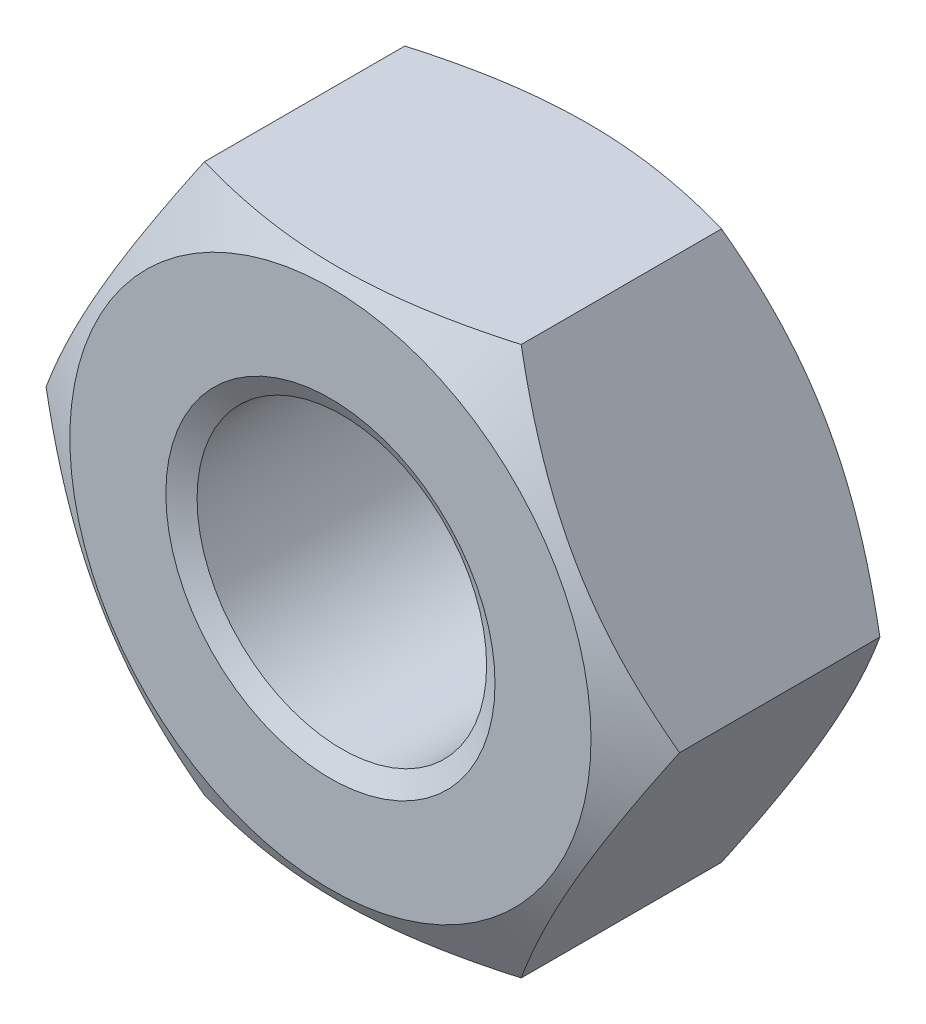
ISO-10303-21;
HEADER;
FILE_DESCRIPTION(('STEP AP214'),'2;1');
FILE_NAME('part.step','',(''),(''),'','','');
FILE_SCHEMA(('AUTOMOTIVE_DESIGN { 1 0 10303 214 1 1 1 1 }'));
ENDSEC;
DATA;
#1=APPLICATION_CONTEXT('core data for automotive mechanical design processes');
#2=APPLICATION_PROTOCOL_DEFINITION('international standard','automotive_design',2000,#1);
#3=PRODUCT_CONTEXT('',#1,'mechanical');
#4=PRODUCT('Part','Part','',(#3));
#5=PRODUCT_RELATED_PRODUCT_CATEGORY('part','',(#4));
#6=PRODUCT_DEFINITION_FORMATION('','',#4);
#7=PRODUCT_DEFINITION_CONTEXT('part definition',#1,'design');
#8=PRODUCT_DEFINITION('design','',#6,#7);
#9=PRODUCT_DEFINITION_SHAPE('','',#8);
#10=(LENGTH_UNIT() NAMED_UNIT(*) SI_UNIT(.MILLI.,.METRE.));
#11=(NAMED_UNIT(*) PLANE_ANGLE_UNIT() SI_UNIT($,.RADIAN.));
#12=(NAMED_UNIT(*) SI_UNIT($,.STERADIAN.) SOLID_ANGLE_UNIT());
#13=UNCERTAINTY_MEASURE_WITH_UNIT(LENGTH_MEASURE(1.E-05),#10,'distance_accuracy_value','');
#14=(GEOMETRIC_REPRESENTATION_CONTEXT(3) GLOBAL_UNCERTAINTY_ASSIGNED_CONTEXT((#13)) GLOBAL_UNIT_ASSIGNED_CONTEXT((#10,
#11,#12)) REPRESENTATION_CONTEXT('',''));
#15=CARTESIAN_POINT('',(0.,0.,0.));
#16=DIRECTION('',(0.,0.,1.));
#17=DIRECTION('',(1.,0.,0.));
#18=AXIS2_PLACEMENT_3D('',#15,#16,#17);
#19=CARTESIAN_POINT('',(0.,0.,0.62498166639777));
#20=DIRECTION('',(0.,0.,-1.));
#21=DIRECTION('',(1.,0.,0.));
#22=AXIS2_PLACEMENT_3D('',#19,#20,#21);
#23=CONICAL_SURFACE('',#22,16.9175,1.0471975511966);
#24=CARTESIAN_POINT('',(0.,0.,1.24996333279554));
#25=DIRECTION('',(0.,0.,1.));
#26=DIRECTION('',(1.,0.,0.));
#27=AXIS2_PLACEMENT_3D('',#24,#25,#26);
#28=CIRCLE('',#27,15.835);
#29=CARTESIAN_POINT('',(15.835,0.,1.24996333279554));
#30=VERTEX_POINT('',#29);
#31=EDGE_CURVE('E11',#30,#30,#28,.T.);
#32=ORIENTED_EDGE('',*,*,#31,.T.);
#33=EDGE_LOOP('',(#32));
#34=FACE_BOUND('',#33,.T.);
#35=CARTESIAN_POINT('',(0.,0.,0.));
#36=DIRECTION('',(0.,0.,1.));
#37=DIRECTION('',(1.,0.,0.));
#38=AXIS2_PLACEMENT_3D('',#35,#36,#37);
#39=CIRCLE('',#38,18.);
#40=CARTESIAN_POINT('',(18.,0.,0.));
#41=VERTEX_POINT('',#40);
#42=EDGE_CURVE('E116',#41,#41,#39,.T.);
#43=ORIENTED_EDGE('',*,*,#42,.F.);
#44=EDGE_LOOP('',(#43));
#45=FACE_BOUND('',#44,.T.);
#46=ADVANCED_FACE('F16',(#34,#45),#23,.F.);
#47=CARTESIAN_POINT('',(0.,0.,14.5));
#48=DIRECTION('',(0.,0.,-1.));
#49=DIRECTION('',(1.,0.,0.));
#50=AXIS2_PLACEMENT_3D('',#47,#48,#49);
#51=CYLINDRICAL_SURFACE('',#50,15.835);
#52=CARTESIAN_POINT('',(0.,0.,27.7500366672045));
#53=DIRECTION('',(0.,0.,1.));
#54=DIRECTION('',(1.,0.,0.));
#55=AXIS2_PLACEMENT_3D('',#52,#53,#54);
#56=CIRCLE('',#55,15.835);
#57=CARTESIAN_POINT('',(15.835,0.,27.7500366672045));
#58=VERTEX_POINT('',#57);
#59=EDGE_CURVE('E27',#58,#58,#56,.T.);
#60=ORIENTED_EDGE('',*,*,#59,.T.);
#61=EDGE_LOOP('',(#60));
#62=FACE_BOUND('',#61,.T.);
#63=ORIENTED_EDGE('',*,*,#31,.F.);
#64=EDGE_LOOP('',(#63));
#65=FACE_BOUND('',#64,.T.);
#66=ADVANCED_FACE('F203',(#62,#65),#51,.F.);
#67=CARTESIAN_POINT('',(0.,0.,28.3750183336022));
#68=DIRECTION('',(0.,0.,1.));
#69=DIRECTION('',(1.,0.,0.));
#70=AXIS2_PLACEMENT_3D('',#67,#68,#69);
#71=CONICAL_SURFACE('',#70,16.9175,1.0471975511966);
#72=CARTESIAN_POINT('',(0.,0.,29.));
#73=DIRECTION('',(0.,0.,-1.));
#74=DIRECTION('',(1.,0.,0.));
#75=AXIS2_PLACEMENT_3D('',#72,#73,#74);
#76=CIRCLE('',#75,18.);
#77=CARTESIAN_POINT('',(18.,0.,29.));
#78=VERTEX_POINT('',#77);
#79=EDGE_CURVE('E112',#78,#78,#76,.T.);
#80=ORIENTED_EDGE('',*,*,#79,.F.);
#81=EDGE_LOOP('',(#80));
#82=FACE_BOUND('',#81,.T.);
#83=ORIENTED_EDGE('',*,*,#59,.F.);
#84=EDGE_LOOP('',(#83));
#85=FACE_BOUND('',#84,.T.);
#86=ADVANCED_FACE('F208',(#82,#85),#71,.F.);
#87=CARTESIAN_POINT('',(0.,0.,1.77275866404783));
#88=DIRECTION('',(0.,0.,1.));
#89=DIRECTION('',(1.,0.,0.));
#90=AXIS2_PLACEMENT_3D('',#87,#88,#89);
#91=CONICAL_SURFACE('',#90,31.5705080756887,1.0471975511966);
#92=CARTESIAN_POINT('',(34.6410161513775,0.,3.54551732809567));
#93=CARTESIAN_POINT('',(25.9807621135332,-15.,-1.45448267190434));
#94=CARTESIAN_POINT('',(17.3205080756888,-30.,3.54551732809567));
#95=(BOUNDED_CURVE() B_SPLINE_CURVE(2,(#92,#93,#94),.UNSPECIFIED.,.F.,
.F.) B_SPLINE_CURVE_WITH_KNOTS((3,3),(0.,35.0530841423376),
.UNSPECIFIED.) CURVE() GEOMETRIC_REPRESENTATION_ITEM() RATIONAL_B_SPLINE_CURVE((1.,
1.15470053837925,1.)) REPRESENTATION_ITEM(''));
#96=CARTESIAN_POINT('',(34.6410161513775,0.,3.54551732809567));
#97=VERTEX_POINT('',#96);
#98=CARTESIAN_POINT('',(17.3205080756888,-30.,3.54551732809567));
#99=VERTEX_POINT('',#98);
#100=EDGE_CURVE('E156',#97,#99,#95,.T.);
#101=ORIENTED_EDGE('',*,*,#100,.T.);
#102=CARTESIAN_POINT('',(17.3205080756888,-30.,3.54551732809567));
#103=CARTESIAN_POINT('',(0.,-30.,-1.45448267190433));
#104=CARTESIAN_POINT('',(-17.3205080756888,-30.,3.54551732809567));
#105=(BOUNDED_CURVE() B_SPLINE_CURVE(2,(#102,#103,#104),.UNSPECIFIED.,.F.,
.F.) B_SPLINE_CURVE_WITH_KNOTS((3,3),(0.,35.0530841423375),
.UNSPECIFIED.) CURVE() GEOMETRIC_REPRESENTATION_ITEM() RATIONAL_B_SPLINE_CURVE((1.,
1.15470053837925,1.)) REPRESENTATION_ITEM(''));
#106=CARTESIAN_POINT('',(-17.3205080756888,-30.,3.54551732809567));
#107=VERTEX_POINT('',#106);
#108=EDGE_CURVE('E110',#99,#107,#105,.T.);
#109=ORIENTED_EDGE('',*,*,#108,.T.);
#110=CARTESIAN_POINT('',(-17.3205080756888,-30.,3.54551732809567));
#111=CARTESIAN_POINT('',(-25.9807621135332,-15.,-1.45448267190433));
#112=CARTESIAN_POINT('',(-34.6410161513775,0.,3.54551732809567));
#113=(BOUNDED_CURVE() B_SPLINE_CURVE(2,(#110,#111,#112),.UNSPECIFIED.,.F.,
.F.) B_SPLINE_CURVE_WITH_KNOTS((3,3),(0.,35.0530841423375),
.UNSPECIFIED.) CURVE() GEOMETRIC_REPRESENTATION_ITEM() RATIONAL_B_SPLINE_CURVE((1.,
1.15470053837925,1.)) REPRESENTATION_ITEM(''));
#114=CARTESIAN_POINT('',(-34.6410161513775,0.,3.54551732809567));
#115=VERTEX_POINT('',#114);
#116=EDGE_CURVE('E125',#107,#115,#113,.T.);
#117=ORIENTED_EDGE('',*,*,#116,.T.);
#118=CARTESIAN_POINT('',(-34.6410161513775,0.,3.54551732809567));
#119=CARTESIAN_POINT('',(-25.9807621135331,15.,-1.45448267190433));
#120=CARTESIAN_POINT('',(-17.3205080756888,30.,3.54551732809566));
#121=(BOUNDED_CURVE() B_SPLINE_CURVE(2,(#118,#119,#120),.UNSPECIFIED.,.F.,
.F.) B_SPLINE_CURVE_WITH_KNOTS((3,3),(0.,35.0530841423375),
.UNSPECIFIED.) CURVE() GEOMETRIC_REPRESENTATION_ITEM() RATIONAL_B_SPLINE_CURVE((1.,
1.15470053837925,1.)) REPRESENTATION_ITEM(''));
#122=CARTESIAN_POINT('',(-17.3205080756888,30.,3.54551732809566));
#123=VERTEX_POINT('',#122);
#124=EDGE_CURVE('E129',#115,#123,#121,.T.);
#125=ORIENTED_EDGE('',*,*,#124,.T.);
#126=CARTESIAN_POINT('',(-17.3205080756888,30.,3.54551732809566));
#127=CARTESIAN_POINT('',(0.,30.,-1.45448267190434));
#128=CARTESIAN_POINT('',(17.3205080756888,30.,3.54551732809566));
#129=(BOUNDED_CURVE() B_SPLINE_CURVE(2,(#126,#127,#128),.UNSPECIFIED.,.F.,
.F.) B_SPLINE_CURVE_WITH_KNOTS((3,3),(0.,35.0530841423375),
.UNSPECIFIED.) CURVE() GEOMETRIC_REPRESENTATION_ITEM() RATIONAL_B_SPLINE_CURVE((1.,
1.15470053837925,1.)) REPRESENTATION_ITEM(''));
#130=CARTESIAN_POINT('',(17.3205080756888,30.,3.54551732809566));
#131=VERTEX_POINT('',#130);
#132=EDGE_CURVE('E163',#123,#131,#129,.T.);
#133=ORIENTED_EDGE('',*,*,#132,.T.);
#134=CARTESIAN_POINT('',(17.3205080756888,30.,3.54551732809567));
#135=CARTESIAN_POINT('',(25.9807621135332,15.,-1.45448267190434));
#136=CARTESIAN_POINT('',(34.6410161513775,0.,3.54551732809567));
#137=(BOUNDED_CURVE() B_SPLINE_CURVE(2,(#134,#135,#136),.UNSPECIFIED.,.F.,
.F.) B_SPLINE_CURVE_WITH_KNOTS((3,3),(0.,35.0530841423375),
.UNSPECIFIED.) CURVE() GEOMETRIC_REPRESENTATION_ITEM() RATIONAL_B_SPLINE_CURVE((1.,
1.15470053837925,1.)) REPRESENTATION_ITEM(''));
#138=EDGE_CURVE('E149',#131,#97,#137,.T.);
#139=ORIENTED_EDGE('',*,*,#138,.T.);
#140=EDGE_LOOP('',(#101,#109,#117,#125,#133,#139));
#141=FACE_BOUND('',#140,.T.);
#142=CARTESIAN_POINT('',(0.,0.,0.));
#143=DIRECTION('',(0.,0.,1.));
#144=DIRECTION('',(1.,0.,0.));
#145=AXIS2_PLACEMENT_3D('',#142,#143,#144);
#146=CIRCLE('',#145,28.5);
#147=CARTESIAN_POINT('',(28.5,0.,0.));
#148=VERTEX_POINT('',#147);
#149=EDGE_CURVE('E105',#148,#148,#146,.T.);
#150=ORIENTED_EDGE('',*,*,#149,.T.);
#151=EDGE_LOOP('',(#150));
#152=FACE_BOUND('',#151,.T.);
#153=ADVANCED_FACE('F189',(#141,#152),#91,.T.);
#154=CARTESIAN_POINT('',(0.,0.,27.2272413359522));
#155=DIRECTION('',(0.,0.,-1.));
#156=DIRECTION('',(1.,0.,0.));
#157=AXIS2_PLACEMENT_3D('',#154,#155,#156);
#158=CONICAL_SURFACE('',#157,31.5705080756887,1.0471975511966);
#159=CARTESIAN_POINT('',(17.3205080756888,-30.,25.4544826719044));
#160=CARTESIAN_POINT('',(25.9807621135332,-15.,30.4544826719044));
#161=CARTESIAN_POINT('',(34.6410161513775,0.,25.4544826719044));
#162=(BOUNDED_CURVE() B_SPLINE_CURVE(2,(#159,#160,#161),.UNSPECIFIED.,.F.,
.F.) B_SPLINE_CURVE_WITH_KNOTS((3,3),(0.,35.0530841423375),
.UNSPECIFIED.) CURVE() GEOMETRIC_REPRESENTATION_ITEM() RATIONAL_B_SPLINE_CURVE((1.,
1.15470053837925,1.)) REPRESENTATION_ITEM(''));
#163=CARTESIAN_POINT('',(17.3205080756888,-30.,25.4544826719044));
#164=VERTEX_POINT('',#163);
#165=CARTESIAN_POINT('',(34.6410161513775,0.,25.4544826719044));
#166=VERTEX_POINT('',#165);
#167=EDGE_CURVE('E91',#164,#166,#162,.T.);
#168=ORIENTED_EDGE('',*,*,#167,.T.);
#169=CARTESIAN_POINT('',(34.6410161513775,0.,25.4544826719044));
#170=CARTESIAN_POINT('',(25.9807621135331,15.,30.4544826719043));
#171=CARTESIAN_POINT('',(17.3205080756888,30.,25.4544826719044));
#172=(BOUNDED_CURVE() B_SPLINE_CURVE(2,(#169,#170,#171),.UNSPECIFIED.,.F.,
.F.) B_SPLINE_CURVE_WITH_KNOTS((3,3),(0.,35.0530841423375),
.UNSPECIFIED.) CURVE() GEOMETRIC_REPRESENTATION_ITEM() RATIONAL_B_SPLINE_CURVE((1.,
1.15470053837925,1.)) REPRESENTATION_ITEM(''));
#173=CARTESIAN_POINT('',(17.3205080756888,30.,25.4544826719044));
#174=VERTEX_POINT('',#173);
#175=EDGE_CURVE('E106',#166,#174,#172,.T.);
#176=ORIENTED_EDGE('',*,*,#175,.T.);
#177=CARTESIAN_POINT('',(17.3205080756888,30.,25.4544826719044));
#178=CARTESIAN_POINT('',(0.,30.,30.4544826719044));
#179=CARTESIAN_POINT('',(-17.3205080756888,30.,25.4544826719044));
#180=(BOUNDED_CURVE() B_SPLINE_CURVE(2,(#177,#178,#179),.UNSPECIFIED.,.F.,
.F.) B_SPLINE_CURVE_WITH_KNOTS((3,3),(0.,35.0530841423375),
.UNSPECIFIED.) CURVE() GEOMETRIC_REPRESENTATION_ITEM() RATIONAL_B_SPLINE_CURVE((1.,
1.15470053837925,1.)) REPRESENTATION_ITEM(''));
#181=CARTESIAN_POINT('',(-17.3205080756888,30.,25.4544826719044));
#182=VERTEX_POINT('',#181);
#183=EDGE_CURVE('E19',#174,#182,#180,.T.);
#184=ORIENTED_EDGE('',*,*,#183,.T.);
#185=CARTESIAN_POINT('',(-17.3205080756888,30.,25.4544826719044));
#186=CARTESIAN_POINT('',(-25.9807621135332,15.,30.4544826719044));
#187=CARTESIAN_POINT('',(-34.6410161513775,0.,25.4544826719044));
#188=(BOUNDED_CURVE() B_SPLINE_CURVE(2,(#185,#186,#187),.UNSPECIFIED.,.F.,
.F.) B_SPLINE_CURVE_WITH_KNOTS((3,3),(0.,35.0530841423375),
.UNSPECIFIED.) CURVE() GEOMETRIC_REPRESENTATION_ITEM() RATIONAL_B_SPLINE_CURVE((1.,
1.15470053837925,1.)) REPRESENTATION_ITEM(''));
#189=CARTESIAN_POINT('',(-34.6410161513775,0.,25.4544826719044));
#190=VERTEX_POINT('',#189);
#191=EDGE_CURVE('E121',#182,#190,#188,.T.);
#192=ORIENTED_EDGE('',*,*,#191,.T.);
#193=CARTESIAN_POINT('',(-34.6410161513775,0.,25.4544826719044));
#194=CARTESIAN_POINT('',(-25.9807621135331,-15.,30.4544826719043));
#195=CARTESIAN_POINT('',(-17.3205080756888,-30.,25.4544826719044));
#196=(BOUNDED_CURVE() B_SPLINE_CURVE(2,(#193,#194,#195),.UNSPECIFIED.,.F.,
.F.) B_SPLINE_CURVE_WITH_KNOTS((3,3),(0.,35.0530841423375),
.UNSPECIFIED.) CURVE() GEOMETRIC_REPRESENTATION_ITEM() RATIONAL_B_SPLINE_CURVE((1.,
1.15470053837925,1.)) REPRESENTATION_ITEM(''));
#197=CARTESIAN_POINT('',(-17.3205080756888,-30.,25.4544826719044));
#198=VERTEX_POINT('',#197);
#199=EDGE_CURVE('E94',#190,#198,#196,.T.);
#200=ORIENTED_EDGE('',*,*,#199,.T.);
#201=CARTESIAN_POINT('',(-17.3205080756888,-30.,25.4544826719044));
#202=CARTESIAN_POINT('',(0.,-30.,30.4544826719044));
#203=CARTESIAN_POINT('',(17.3205080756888,-30.,25.4544826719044));
#204=(BOUNDED_CURVE() B_SPLINE_CURVE(2,(#201,#202,#203),.UNSPECIFIED.,.F.,
.F.) B_SPLINE_CURVE_WITH_KNOTS((3,3),(0.,35.0530841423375),
.UNSPECIFIED.) CURVE() GEOMETRIC_REPRESENTATION_ITEM() RATIONAL_B_SPLINE_CURVE((1.,
1.15470053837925,1.)) REPRESENTATION_ITEM(''));
#205=EDGE_CURVE('E83',#198,#164,#204,.T.);
#206=ORIENTED_EDGE('',*,*,#205,.T.);
#207=EDGE_LOOP('',(#168,#176,#184,#192,#200,#206));
#208=FACE_BOUND('',#207,.T.);
#209=CARTESIAN_POINT('',(0.,0.,29.));
#210=DIRECTION('',(0.,0.,-1.));
#211=DIRECTION('',(1.,0.,0.));
#212=AXIS2_PLACEMENT_3D('',#209,#210,#211);
#213=CIRCLE('',#212,28.5);
#214=CARTESIAN_POINT('',(28.5,0.,29.));
#215=VERTEX_POINT('',#214);
#216=EDGE_CURVE('E96',#215,#215,#213,.T.);
#217=ORIENTED_EDGE('',*,*,#216,.T.);
#218=EDGE_LOOP('',(#217));
#219=FACE_BOUND('',#218,.T.);
#220=ADVANCED_FACE('F88',(#208,#219),#158,.T.);
#221=CARTESIAN_POINT('',(-25.9807621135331,15.,0.));
#222=DIRECTION('',(-0.866025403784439,0.5,0.));
#223=DIRECTION('',(-0.5,-0.866025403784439,0.));
#224=AXIS2_PLACEMENT_3D('',#221,#222,#223);
#225=PLANE('',#224);
#226=ORIENTED_EDGE('',*,*,#191,.F.);
#227=DIRECTION('',(0.,0.,1.));
#228=VECTOR('',#227,1.);
#229=CARTESIAN_POINT('',(-17.3205080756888,30.,0.));
#230=LINE('',#229,#228);
#231=EDGE_CURVE('E135',#123,#182,#230,.T.);
#232=ORIENTED_EDGE('',*,*,#231,.F.);
#233=ORIENTED_EDGE('',*,*,#124,.F.);
#234=DIRECTION('',(0.,0.,1.));
#235=VECTOR('',#234,1.);
#236=CARTESIAN_POINT('',(-34.6410161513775,0.,0.));
#237=LINE('',#236,#235);
#238=EDGE_CURVE('E130',#115,#190,#237,.T.);
#239=ORIENTED_EDGE('',*,*,#238,.T.);
#240=EDGE_LOOP('',(#226,#232,#233,#239));
#241=FACE_BOUND('',#240,.T.);
#242=ADVANCED_FACE('F185',(#241),#225,.T.);
#243=CARTESIAN_POINT('',(0.,30.,0.));
#244=DIRECTION('',(0.,1.,0.));
#245=DIRECTION('',(-1.,0.,0.));
#246=AXIS2_PLACEMENT_3D('',#243,#244,#245);
#247=PLANE('',#246);
#248=ORIENTED_EDGE('',*,*,#183,.F.);
#249=DIRECTION('',(0.,0.,1.));
#250=VECTOR('',#249,1.);
#251=CARTESIAN_POINT('',(17.3205080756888,30.,0.));
#252=LINE('',#251,#250);
#253=EDGE_CURVE('E141',#131,#174,#252,.T.);
#254=ORIENTED_EDGE('',*,*,#253,.F.);
#255=ORIENTED_EDGE('',*,*,#132,.F.);
#256=ORIENTED_EDGE('',*,*,#231,.T.);
#257=EDGE_LOOP('',(#248,#254,#255,#256));
#258=FACE_BOUND('',#257,.T.);
#259=ADVANCED_FACE('F227',(#258),#247,.T.);
#260=CARTESIAN_POINT('',(25.9807621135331,15.,0.));
#261=DIRECTION('',(0.866025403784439,0.5,0.));
#262=DIRECTION('',(-0.5,0.866025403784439,0.));
#263=AXIS2_PLACEMENT_3D('',#260,#261,#262);
#264=PLANE('',#263);
#265=ORIENTED_EDGE('',*,*,#175,.F.);
#266=DIRECTION('',(0.,0.,1.));
#267=VECTOR('',#266,1.);
#268=CARTESIAN_POINT('',(34.6410161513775,0.,0.));
#269=LINE('',#268,#267);
#270=EDGE_CURVE('E104',#97,#166,#269,.T.);
#271=ORIENTED_EDGE('',*,*,#270,.F.);
#272=ORIENTED_EDGE('',*,*,#138,.F.);
#273=ORIENTED_EDGE('',*,*,#253,.T.);
#274=EDGE_LOOP('',(#265,#271,#272,#273));
#275=FACE_BOUND('',#274,.T.);
#276=ADVANCED_FACE('F229',(#275),#264,.T.);
#277=CARTESIAN_POINT('',(25.9807621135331,-15.,0.));
#278=DIRECTION('',(0.866025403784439,-0.5,0.));
#279=DIRECTION('',(0.5,0.866025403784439,0.));
#280=AXIS2_PLACEMENT_3D('',#277,#278,#279);
#281=PLANE('',#280);
#282=ORIENTED_EDGE('',*,*,#167,.F.);
#283=DIRECTION('',(0.,0.,1.));
#284=VECTOR('',#283,1.);
#285=CARTESIAN_POINT('',(17.3205080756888,-30.,0.));
#286=LINE('',#285,#284);
#287=EDGE_CURVE('E102',#99,#164,#286,.T.);
#288=ORIENTED_EDGE('',*,*,#287,.F.);
#289=ORIENTED_EDGE('',*,*,#100,.F.);
#290=ORIENTED_EDGE('',*,*,#270,.T.);
#291=EDGE_LOOP('',(#282,#288,#289,#290));
#292=FACE_BOUND('',#291,.T.);
#293=ADVANCED_FACE('F100',(#292),#281,.T.);
#294=CARTESIAN_POINT('',(0.,0.,0.));
#295=DIRECTION('',(0.,0.,1.));
#296=DIRECTION('',(0.,-1.,0.));
#297=AXIS2_PLACEMENT_3D('',#294,#295,#296);
#298=PLANE('',#297);
#299=ORIENTED_EDGE('',*,*,#42,.T.);
#300=EDGE_LOOP('',(#299));
#301=FACE_BOUND('',#300,.T.);
#302=ORIENTED_EDGE('',*,*,#149,.F.);
#303=EDGE_LOOP('',(#302));
#304=FACE_BOUND('',#303,.T.);
#305=ADVANCED_FACE('F213',(#301,#304),#298,.F.);
#306=CARTESIAN_POINT('',(0.,0.,29.));
#307=DIRECTION('',(0.,0.,1.));
#308=DIRECTION('',(0.,-1.,0.));
#309=AXIS2_PLACEMENT_3D('',#306,#307,#308);
#310=PLANE('',#309);
#311=ORIENTED_EDGE('',*,*,#79,.T.);
#312=EDGE_LOOP('',(#311));
#313=FACE_BOUND('',#312,.T.);
#314=ORIENTED_EDGE('',*,*,#216,.F.);
#315=EDGE_LOOP('',(#314));
#316=FACE_BOUND('',#315,.T.);
#317=ADVANCED_FACE('F199',(#313,#316),#310,.T.);
#318=CARTESIAN_POINT('',(0.,-30.,0.));
#319=DIRECTION('',(0.,-1.,0.));
#320=DIRECTION('',(1.,0.,0.));
#321=AXIS2_PLACEMENT_3D('',#318,#319,#320);
#322=PLANE('',#321);
#323=ORIENTED_EDGE('',*,*,#205,.F.);
#324=DIRECTION('',(0.,0.,1.));
#325=VECTOR('',#324,1.);
#326=CARTESIAN_POINT('',(-17.3205080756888,-30.,0.));
#327=LINE('',#326,#325);
#328=EDGE_CURVE('E113',#107,#198,#327,.T.);
#329=ORIENTED_EDGE('',*,*,#328,.F.);
#330=ORIENTED_EDGE('',*,*,#108,.F.);
#331=ORIENTED_EDGE('',*,*,#287,.T.);
#332=EDGE_LOOP('',(#323,#329,#330,#331));
#333=FACE_BOUND('',#332,.T.);
#334=ADVANCED_FACE('F108',(#333),#322,.T.);
#335=CARTESIAN_POINT('',(-25.9807621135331,-15.,0.));
#336=DIRECTION('',(-0.866025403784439,-0.5,0.));
#337=DIRECTION('',(0.5,-0.866025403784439,0.));
#338=AXIS2_PLACEMENT_3D('',#335,#336,#337);
#339=PLANE('',#338);
#340=ORIENTED_EDGE('',*,*,#199,.F.);
#341=ORIENTED_EDGE('',*,*,#238,.F.);
#342=ORIENTED_EDGE('',*,*,#116,.F.);
#343=ORIENTED_EDGE('',*,*,#328,.T.);
#344=EDGE_LOOP('',(#340,#341,#342,#343));
#345=FACE_BOUND('',#344,.T.);
#346=ADVANCED_FACE('F192',(#345),#339,.T.);
#347=CLOSED_SHELL('',(#46,#66,#86,#153,#220,#242,#259,#276,#293,#305,#317,#334,#346));
#348=MANIFOLD_SOLID_BREP('B1',#347);
#349=ADVANCED_BREP_SHAPE_REPRESENTATION('',(#18,#348),#14);
#350=SHAPE_DEFINITION_REPRESENTATION(#9,#349);
ENDSEC;
END-ISO-10303-21;
